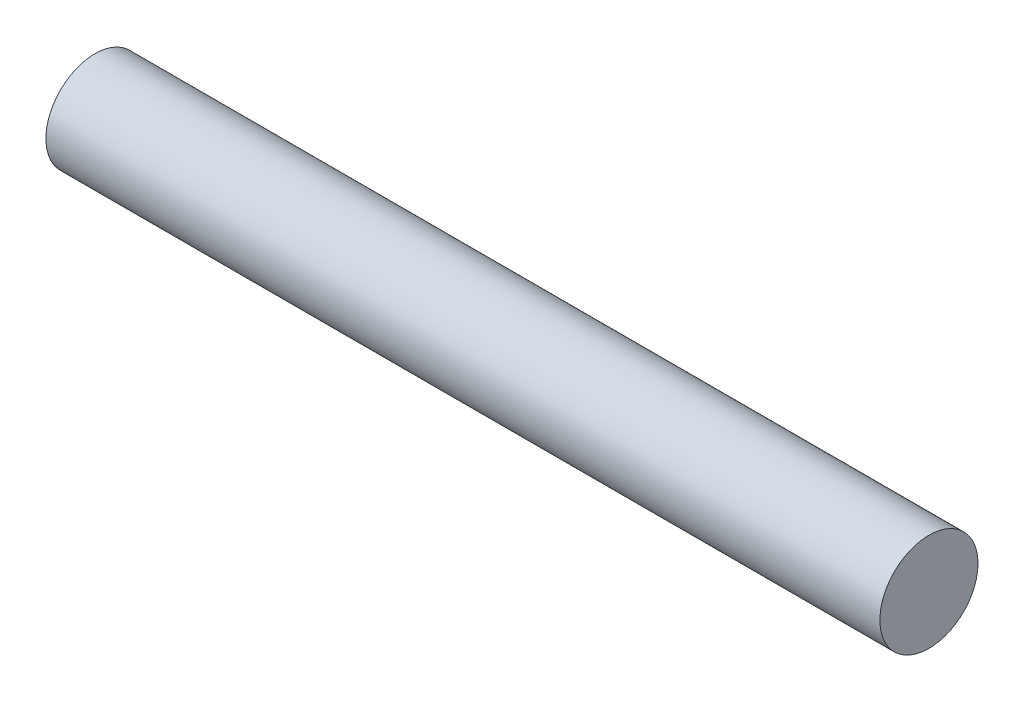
ISO-10303-21;
HEADER;
FILE_DESCRIPTION(('STEP AP214'),'2;1');
FILE_NAME('part.step','',(''),(''),'','','');
FILE_SCHEMA(('AUTOMOTIVE_DESIGN { 1 0 10303 214 1 1 1 1 }'));
ENDSEC;
DATA;
#1=APPLICATION_CONTEXT('core data for automotive mechanical design processes');
#2=APPLICATION_PROTOCOL_DEFINITION('international standard','automotive_design',2000,#1);
#3=PRODUCT_CONTEXT('',#1,'mechanical');
#4=PRODUCT('Part','Part','',(#3));
#5=PRODUCT_RELATED_PRODUCT_CATEGORY('part','',(#4));
#6=PRODUCT_DEFINITION_FORMATION('','',#4);
#7=PRODUCT_DEFINITION_CONTEXT('part definition',#1,'design');
#8=PRODUCT_DEFINITION('design','',#6,#7);
#9=PRODUCT_DEFINITION_SHAPE('','',#8);
#10=(LENGTH_UNIT() NAMED_UNIT(*) SI_UNIT(.MILLI.,.METRE.));
#11=(NAMED_UNIT(*) PLANE_ANGLE_UNIT() SI_UNIT($,.RADIAN.));
#12=(NAMED_UNIT(*) SI_UNIT($,.STERADIAN.) SOLID_ANGLE_UNIT());
#13=UNCERTAINTY_MEASURE_WITH_UNIT(LENGTH_MEASURE(1.E-05),#10,'distance_accuracy_value','');
#14=(GEOMETRIC_REPRESENTATION_CONTEXT(3) GLOBAL_UNCERTAINTY_ASSIGNED_CONTEXT((#13)) GLOBAL_UNIT_ASSIGNED_CONTEXT((#10,
#11,#12)) REPRESENTATION_CONTEXT('',''));
#15=CARTESIAN_POINT('',(0.,0.,0.));
#16=DIRECTION('',(0.,0.,1.));
#17=DIRECTION('',(1.,0.,0.));
#18=AXIS2_PLACEMENT_3D('',#15,#16,#17);
#19=CARTESIAN_POINT('',(215.9,0.,0.));
#20=DIRECTION('',(-1.,0.,0.));
#21=DIRECTION('',(0.,0.,1.));
#22=AXIS2_PLACEMENT_3D('',#19,#20,#21);
#23=CYLINDRICAL_SURFACE('',#22,12.7);
#24=CARTESIAN_POINT('',(215.9,0.,0.));
#25=DIRECTION('',(1.,0.,0.));
#26=DIRECTION('',(0.,0.,-1.));
#27=AXIS2_PLACEMENT_3D('',#24,#25,#26);
#28=CIRCLE('',#27,12.7);
#29=CARTESIAN_POINT('',(215.9,0.,-12.7));
#30=VERTEX_POINT('',#29);
#31=EDGE_CURVE('E12',#30,#30,#28,.T.);
#32=ORIENTED_EDGE('',*,*,#31,.F.);
#33=EDGE_LOOP('',(#32));
#34=FACE_BOUND('',#33,.T.);
#35=CARTESIAN_POINT('',(0.,0.,0.));
#36=DIRECTION('',(1.,0.,0.));
#37=DIRECTION('',(0.,0.,-1.));
#38=AXIS2_PLACEMENT_3D('',#35,#36,#37);
#39=CIRCLE('',#38,12.7);
#40=CARTESIAN_POINT('',(0.,0.,-12.7));
#41=VERTEX_POINT('',#40);
#42=EDGE_CURVE('E48',#41,#41,#39,.T.);
#43=ORIENTED_EDGE('',*,*,#42,.T.);
#44=EDGE_LOOP('',(#43));
#45=FACE_BOUND('',#44,.T.);
#46=ADVANCED_FACE('F45',(#34,#45),#23,.T.);
#47=CARTESIAN_POINT('',(215.9,0.,0.));
#48=DIRECTION('',(1.,0.,0.));
#49=DIRECTION('',(0.,0.,-1.));
#50=AXIS2_PLACEMENT_3D('',#47,#48,#49);
#51=PLANE('',#50);
#52=ORIENTED_EDGE('',*,*,#31,.T.);
#53=EDGE_LOOP('',(#52));
#54=FACE_BOUND('',#53,.T.);
#55=ADVANCED_FACE('F60',(#54),#51,.T.);
#56=CARTESIAN_POINT('',(0.,0.,0.));
#57=DIRECTION('',(1.,0.,0.));
#58=DIRECTION('',(0.,0.,-1.));
#59=AXIS2_PLACEMENT_3D('',#56,#57,#58);
#60=PLANE('',#59);
#61=ORIENTED_EDGE('',*,*,#42,.F.);
#62=EDGE_LOOP('',(#61));
#63=FACE_BOUND('',#62,.T.);
#64=ADVANCED_FACE('F58',(#63),#60,.F.);
#65=CLOSED_SHELL('',(#46,#55,#64));
#66=MANIFOLD_SOLID_BREP('B2',#65);
#67=ADVANCED_BREP_SHAPE_REPRESENTATION('',(#18,#66),#14);
#68=SHAPE_DEFINITION_REPRESENTATION(#9,#67);
ENDSEC;
END-ISO-10303-21;
